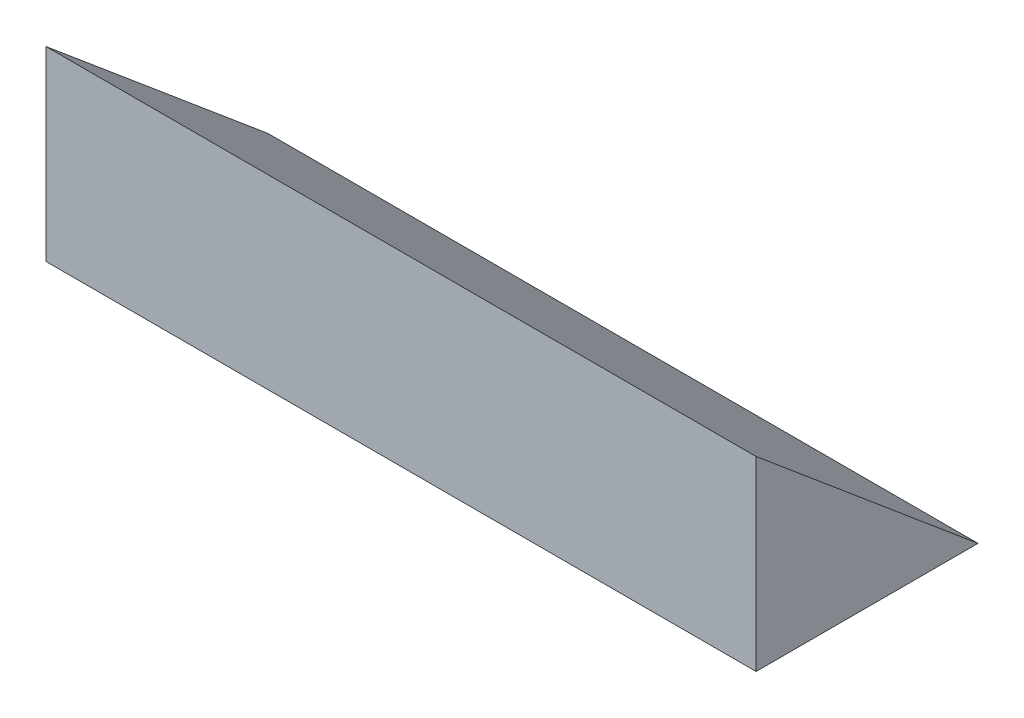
from build123d import *

# Parameters (mm, degrees)
BOSS_EXTRU_1_DEPTH      = 1600
ESQUISSE2_R             = 5
ENL_V_MAT_EXTRU_1_DEPTH = 10


with BuildPart() as part:
    # Esquisse1 → Boss.-Extru.1 (new body)
    with BuildSketch(Plane(origin=(0, 0, 0), x_dir=(0, 0, -1), z_dir=(1, 0, 0))):
        Polygon((0, 0), (500, 0), (0, 419.549815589), align=None)
    extrude(amount=BOSS_EXTRU_1_DEPTH)

    # Esquisse2 → Enl_v. mat.-Extru.1 (cut)
    with BuildSketch(Plane.XZ):
        with Locations(Location((550, -250, 0), (0, 0, 270))):
            Circle(ESQUISSE2_R)
        with Locations(Location((1050, -250, 0), (0, 0, 90))):
            Circle(ESQUISSE2_R)
    extrude(amount=-ENL_V_MAT_EXTRU_1_DEPTH, mode=Mode.SUBTRACT)


solid = part.part
